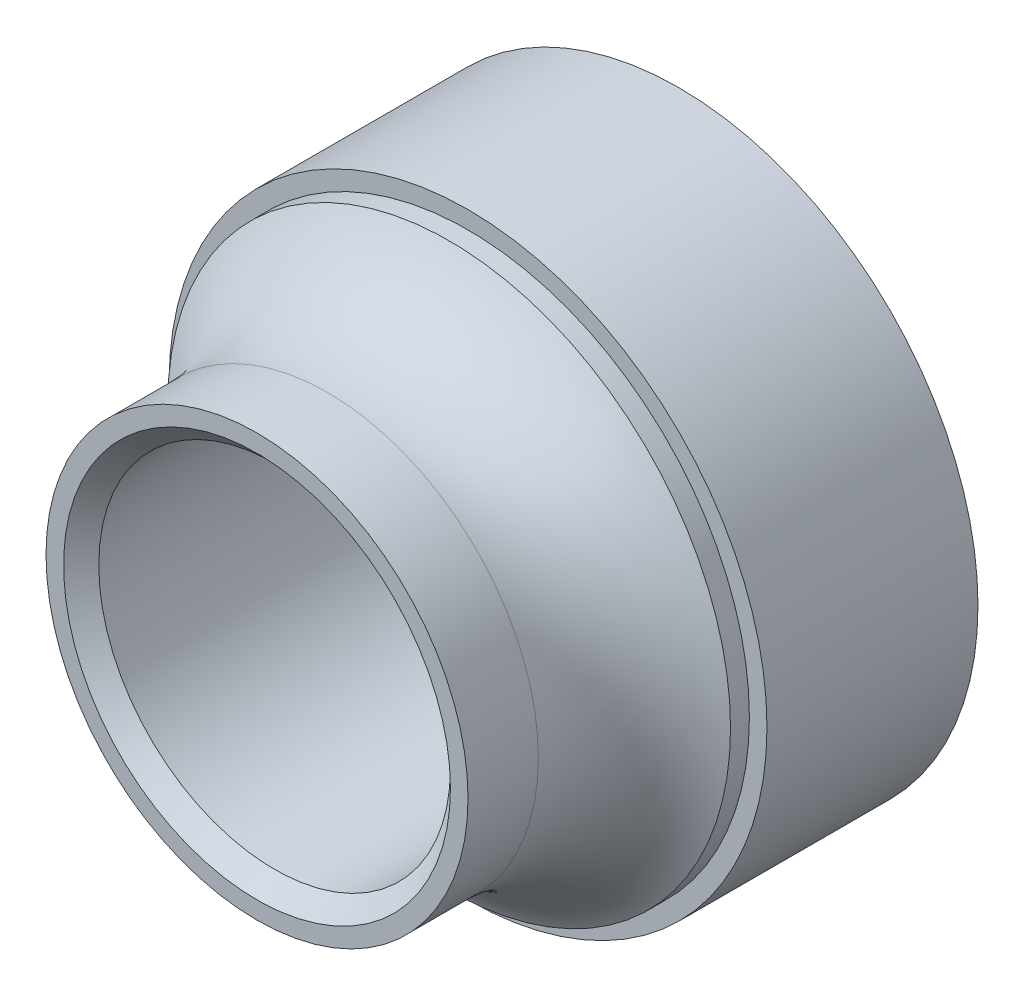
ISO-10303-21;
HEADER;
FILE_DESCRIPTION(('STEP AP214'),'2;1');
FILE_NAME('part.step','',(''),(''),'','','');
FILE_SCHEMA(('AUTOMOTIVE_DESIGN { 1 0 10303 214 1 1 1 1 }'));
ENDSEC;
DATA;
#1=APPLICATION_CONTEXT('core data for automotive mechanical design processes');
#2=APPLICATION_PROTOCOL_DEFINITION('international standard','automotive_design',2000,#1);
#3=PRODUCT_CONTEXT('',#1,'mechanical');
#4=PRODUCT('Part','Part','',(#3));
#5=PRODUCT_RELATED_PRODUCT_CATEGORY('part','',(#4));
#6=PRODUCT_DEFINITION_FORMATION('','',#4);
#7=PRODUCT_DEFINITION_CONTEXT('part definition',#1,'design');
#8=PRODUCT_DEFINITION('design','',#6,#7);
#9=PRODUCT_DEFINITION_SHAPE('','',#8);
#10=(LENGTH_UNIT() NAMED_UNIT(*) SI_UNIT(.MILLI.,.METRE.));
#11=(NAMED_UNIT(*) PLANE_ANGLE_UNIT() SI_UNIT($,.RADIAN.));
#12=(NAMED_UNIT(*) SI_UNIT($,.STERADIAN.) SOLID_ANGLE_UNIT());
#13=UNCERTAINTY_MEASURE_WITH_UNIT(LENGTH_MEASURE(1.E-05),#10,'distance_accuracy_value','');
#14=(GEOMETRIC_REPRESENTATION_CONTEXT(3) GLOBAL_UNCERTAINTY_ASSIGNED_CONTEXT((#13)) GLOBAL_UNIT_ASSIGNED_CONTEXT((#10,
#11,#12)) REPRESENTATION_CONTEXT('',''));
#15=CARTESIAN_POINT('',(0.,0.,0.));
#16=DIRECTION('',(0.,0.,1.));
#17=DIRECTION('',(1.,0.,0.));
#18=AXIS2_PLACEMENT_3D('',#15,#16,#17);
#19=CARTESIAN_POINT('',(0.,0.,12.));
#20=DIRECTION('',(0.,0.,-1.));
#21=DIRECTION('',(-1.,0.,0.));
#22=AXIS2_PLACEMENT_3D('',#19,#20,#21);
#23=CYLINDRICAL_SURFACE('',#22,8.);
#24=CARTESIAN_POINT('',(0.,0.,6.));
#25=DIRECTION('',(0.,0.,1.));
#26=DIRECTION('',(1.,0.,0.));
#27=AXIS2_PLACEMENT_3D('',#24,#25,#26);
#28=CIRCLE('',#27,8.);
#29=CARTESIAN_POINT('',(8.,0.,6.));
#30=VERTEX_POINT('',#29);
#31=EDGE_CURVE('E53',#30,#30,#28,.T.);
#32=ORIENTED_EDGE('',*,*,#31,.T.);
#33=EDGE_LOOP('',(#32));
#34=FACE_BOUND('',#33,.T.);
#35=CARTESIAN_POINT('',(0.,0.,6.53589838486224));
#36=DIRECTION('',(0.,0.,1.));
#37=DIRECTION('',(1.,0.,0.));
#38=AXIS2_PLACEMENT_3D('',#35,#36,#37);
#39=CIRCLE('',#38,8.);
#40=CARTESIAN_POINT('',(8.,0.,6.53589838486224));
#41=VERTEX_POINT('',#40);
#42=EDGE_CURVE('E58',#41,#41,#39,.T.);
#43=ORIENTED_EDGE('',*,*,#42,.F.);
#44=EDGE_LOOP('',(#43));
#45=FACE_BOUND('',#44,.T.);
#46=ADVANCED_FACE('F29',(#34,#45),#23,.T.);
#47=CARTESIAN_POINT('',(0.,0.,6.));
#48=DIRECTION('',(0.,0.,1.));
#49=DIRECTION('',(1.,0.,0.));
#50=AXIS2_PLACEMENT_3D('',#47,#48,#49);
#51=PLANE('',#50);
#52=CARTESIAN_POINT('',(0.,0.,6.));
#53=DIRECTION('',(0.,0.,1.));
#54=DIRECTION('',(1.,0.,0.));
#55=AXIS2_PLACEMENT_3D('',#52,#53,#54);
#56=CIRCLE('',#55,8.5);
#57=CARTESIAN_POINT('',(8.5,0.,6.));
#58=VERTEX_POINT('',#57);
#59=EDGE_CURVE('E49',#58,#58,#56,.T.);
#60=ORIENTED_EDGE('',*,*,#59,.T.);
#61=EDGE_LOOP('',(#60));
#62=FACE_BOUND('',#61,.T.);
#63=ORIENTED_EDGE('',*,*,#31,.F.);
#64=EDGE_LOOP('',(#63));
#65=FACE_BOUND('',#64,.T.);
#66=ADVANCED_FACE('F86',(#62,#65),#51,.T.);
#67=CARTESIAN_POINT('',(0.,0.,6.));
#68=DIRECTION('',(0.,0.,-1.));
#69=DIRECTION('',(-1.,0.,0.));
#70=AXIS2_PLACEMENT_3D('',#67,#68,#69);
#71=CYLINDRICAL_SURFACE('',#70,8.5);
#72=ORIENTED_EDGE('',*,*,#59,.F.);
#73=EDGE_LOOP('',(#72));
#74=FACE_BOUND('',#73,.T.);
#75=CARTESIAN_POINT('',(0.,0.,0.));
#76=DIRECTION('',(0.,0.,1.));
#77=DIRECTION('',(1.,0.,0.));
#78=AXIS2_PLACEMENT_3D('',#75,#76,#77);
#79=CIRCLE('',#78,8.5);
#80=CARTESIAN_POINT('',(8.5,0.,0.));
#81=VERTEX_POINT('',#80);
#82=EDGE_CURVE('E50',#81,#81,#79,.T.);
#83=ORIENTED_EDGE('',*,*,#82,.T.);
#84=EDGE_LOOP('',(#83));
#85=FACE_BOUND('',#84,.T.);
#86=ADVANCED_FACE('F82',(#74,#85),#71,.T.);
#87=CARTESIAN_POINT('',(0.,0.,0.));
#88=DIRECTION('',(0.,0.,1.));
#89=DIRECTION('',(1.,0.,0.));
#90=AXIS2_PLACEMENT_3D('',#87,#88,#89);
#91=PLANE('',#90);
#92=CARTESIAN_POINT('',(0.,0.,0.));
#93=DIRECTION('',(0.,0.,1.));
#94=DIRECTION('',(1.,0.,0.));
#95=AXIS2_PLACEMENT_3D('',#92,#93,#94);
#96=CIRCLE('',#95,5.50000000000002);
#97=CARTESIAN_POINT('',(5.50000000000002,0.,0.));
#98=VERTEX_POINT('',#97);
#99=EDGE_CURVE('E10',#98,#98,#96,.T.);
#100=ORIENTED_EDGE('',*,*,#99,.T.);
#101=EDGE_LOOP('',(#100));
#102=FACE_BOUND('',#101,.T.);
#103=ORIENTED_EDGE('',*,*,#82,.F.);
#104=EDGE_LOOP('',(#103));
#105=FACE_BOUND('',#104,.T.);
#106=ADVANCED_FACE('F73',(#102,#105),#91,.F.);
#107=CARTESIAN_POINT('',(0.,0.,10.));
#108=DIRECTION('',(0.,0.,1.));
#109=DIRECTION('',(1.,0.,0.));
#110=AXIS2_PLACEMENT_3D('',#107,#108,#109);
#111=TOROIDAL_SURFACE('',#110,10.,4.);
#112=ORIENTED_EDGE('',*,*,#42,.T.);
#113=EDGE_LOOP('',(#112));
#114=FACE_BOUND('',#113,.T.);
#115=CARTESIAN_POINT('',(0.,0.,10.));
#116=DIRECTION('',(0.,0.,1.));
#117=DIRECTION('',(1.,0.,0.));
#118=AXIS2_PLACEMENT_3D('',#115,#116,#117);
#119=CIRCLE('',#118,6.);
#120=CARTESIAN_POINT('',(6.,0.,10.));
#121=VERTEX_POINT('',#120);
#122=EDGE_CURVE('E64',#121,#121,#119,.T.);
#123=ORIENTED_EDGE('',*,*,#122,.F.);
#124=EDGE_LOOP('',(#123));
#125=FACE_BOUND('',#124,.T.);
#126=ADVANCED_FACE('F71',(#114,#125),#111,.F.);
#127=CARTESIAN_POINT('',(0.,0.,12.));
#128=DIRECTION('',(0.,0.,1.));
#129=DIRECTION('',(1.,0.,0.));
#130=AXIS2_PLACEMENT_3D('',#127,#128,#129);
#131=CYLINDRICAL_SURFACE('',#130,6.);
#132=ORIENTED_EDGE('',*,*,#122,.T.);
#133=EDGE_LOOP('',(#132));
#134=FACE_BOUND('',#133,.T.);
#135=CARTESIAN_POINT('',(0.,0.,12.));
#136=DIRECTION('',(0.,0.,1.));
#137=DIRECTION('',(1.,0.,0.));
#138=AXIS2_PLACEMENT_3D('',#135,#136,#137);
#139=CIRCLE('',#138,6.);
#140=CARTESIAN_POINT('',(6.,0.,12.));
#141=VERTEX_POINT('',#140);
#142=EDGE_CURVE('E61',#141,#141,#139,.T.);
#143=ORIENTED_EDGE('',*,*,#142,.F.);
#144=EDGE_LOOP('',(#143));
#145=FACE_BOUND('',#144,.T.);
#146=ADVANCED_FACE('F68',(#134,#145),#131,.T.);
#147=CARTESIAN_POINT('',(0.,0.,12.));
#148=DIRECTION('',(0.,0.,1.));
#149=DIRECTION('',(1.,0.,0.));
#150=AXIS2_PLACEMENT_3D('',#147,#148,#149);
#151=PLANE('',#150);
#152=CARTESIAN_POINT('',(0.,0.,12.));
#153=DIRECTION('',(0.,0.,1.));
#154=DIRECTION('',(1.,0.,0.));
#155=AXIS2_PLACEMENT_3D('',#152,#153,#154);
#156=CIRCLE('',#155,5.50000000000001);
#157=CARTESIAN_POINT('',(5.50000000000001,0.,12.));
#158=VERTEX_POINT('',#157);
#159=EDGE_CURVE('E36',#158,#158,#156,.F.);
#160=ORIENTED_EDGE('',*,*,#159,.T.);
#161=EDGE_LOOP('',(#160));
#162=FACE_BOUND('',#161,.T.);
#163=ORIENTED_EDGE('',*,*,#142,.T.);
#164=EDGE_LOOP('',(#163));
#165=FACE_BOUND('',#164,.T.);
#166=ADVANCED_FACE('F80',(#162,#165),#151,.T.);
#167=CARTESIAN_POINT('',(0.,0.,96.));
#168=DIRECTION('',(0.,0.,-1.));
#169=DIRECTION('',(-1.,0.,0.));
#170=AXIS2_PLACEMENT_3D('',#167,#168,#169);
#171=CYLINDRICAL_SURFACE('',#170,5.);
#172=CARTESIAN_POINT('',(0.,0.,11.5));
#173=DIRECTION('',(0.,0.,1.));
#174=DIRECTION('',(1.,0.,0.));
#175=AXIS2_PLACEMENT_3D('',#172,#173,#174);
#176=CIRCLE('',#175,5.);
#177=CARTESIAN_POINT('',(5.,0.,11.5));
#178=VERTEX_POINT('',#177);
#179=EDGE_CURVE('E40',#178,#178,#176,.T.);
#180=ORIENTED_EDGE('',*,*,#179,.T.);
#181=EDGE_LOOP('',(#180));
#182=FACE_BOUND('',#181,.T.);
#183=CARTESIAN_POINT('',(0.,0.,0.500000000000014));
#184=DIRECTION('',(0.,0.,1.));
#185=DIRECTION('',(1.,0.,0.));
#186=AXIS2_PLACEMENT_3D('',#183,#184,#185);
#187=CIRCLE('',#186,5.);
#188=CARTESIAN_POINT('',(5.,0.,0.500000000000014));
#189=VERTEX_POINT('',#188);
#190=EDGE_CURVE('E44',#189,#189,#187,.F.);
#191=ORIENTED_EDGE('',*,*,#190,.T.);
#192=EDGE_LOOP('',(#191));
#193=FACE_BOUND('',#192,.T.);
#194=ADVANCED_FACE('F100',(#182,#193),#171,.F.);
#195=CARTESIAN_POINT('',(0.,0.,11.5));
#196=DIRECTION('',(0.,0.,1.));
#197=DIRECTION('',(1.,0.,0.));
#198=AXIS2_PLACEMENT_3D('',#195,#196,#197);
#199=CONICAL_SURFACE('',#198,5.,0.785398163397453);
#200=ORIENTED_EDGE('',*,*,#159,.F.);
#201=EDGE_LOOP('',(#200));
#202=FACE_BOUND('',#201,.T.);
#203=ORIENTED_EDGE('',*,*,#179,.F.);
#204=EDGE_LOOP('',(#203));
#205=FACE_BOUND('',#204,.T.);
#206=ADVANCED_FACE('F98',(#202,#205),#199,.F.);
#207=CARTESIAN_POINT('',(0.,0.,0.500000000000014));
#208=DIRECTION('',(0.,0.,-1.));
#209=DIRECTION('',(-1.,0.,0.));
#210=AXIS2_PLACEMENT_3D('',#207,#208,#209);
#211=CONICAL_SURFACE('',#210,5.,0.785398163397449);
#212=ORIENTED_EDGE('',*,*,#99,.F.);
#213=EDGE_LOOP('',(#212));
#214=FACE_BOUND('',#213,.T.);
#215=ORIENTED_EDGE('',*,*,#190,.F.);
#216=EDGE_LOOP('',(#215));
#217=FACE_BOUND('',#216,.T.);
#218=ADVANCED_FACE('F31',(#214,#217),#211,.F.);
#219=CLOSED_SHELL('',(#46,#66,#86,#106,#126,#146,#166,#194,#206,#218));
#220=MANIFOLD_SOLID_BREP('B2',#219);
#221=ADVANCED_BREP_SHAPE_REPRESENTATION('',(#18,#220),#14);
#222=SHAPE_DEFINITION_REPRESENTATION(#9,#221);
ENDSEC;
END-ISO-10303-21;
